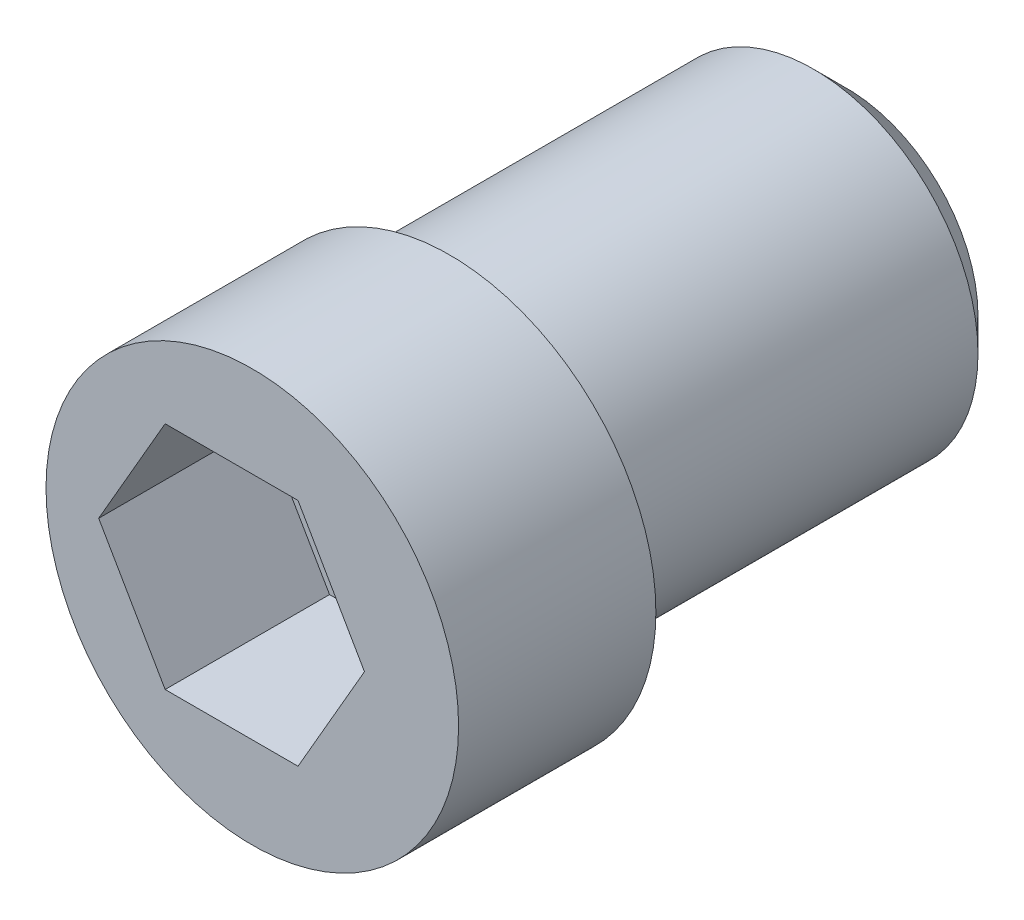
ISO-10303-21;
HEADER;
FILE_DESCRIPTION(('STEP AP214'),'2;1');
FILE_NAME('part.step','',(''),(''),'','','');
FILE_SCHEMA(('AUTOMOTIVE_DESIGN { 1 0 10303 214 1 1 1 1 }'));
ENDSEC;
DATA;
#1=APPLICATION_CONTEXT('core data for automotive mechanical design processes');
#2=APPLICATION_PROTOCOL_DEFINITION('international standard','automotive_design',2000,#1);
#3=PRODUCT_CONTEXT('',#1,'mechanical');
#4=PRODUCT('Part','Part','',(#3));
#5=PRODUCT_RELATED_PRODUCT_CATEGORY('part','',(#4));
#6=PRODUCT_DEFINITION_FORMATION('','',#4);
#7=PRODUCT_DEFINITION_CONTEXT('part definition',#1,'design');
#8=PRODUCT_DEFINITION('design','',#6,#7);
#9=PRODUCT_DEFINITION_SHAPE('','',#8);
#10=(LENGTH_UNIT() NAMED_UNIT(*) SI_UNIT(.MILLI.,.METRE.));
#11=(NAMED_UNIT(*) PLANE_ANGLE_UNIT() SI_UNIT($,.RADIAN.));
#12=(NAMED_UNIT(*) SI_UNIT($,.STERADIAN.) SOLID_ANGLE_UNIT());
#13=UNCERTAINTY_MEASURE_WITH_UNIT(LENGTH_MEASURE(1.E-05),#10,'distance_accuracy_value','');
#14=(GEOMETRIC_REPRESENTATION_CONTEXT(3) GLOBAL_UNCERTAINTY_ASSIGNED_CONTEXT((#13)) GLOBAL_UNIT_ASSIGNED_CONTEXT((#10,
#11,#12)) REPRESENTATION_CONTEXT('',''));
#15=CARTESIAN_POINT('',(0.,0.,0.));
#16=DIRECTION('',(0.,0.,1.));
#17=DIRECTION('',(1.,0.,0.));
#18=AXIS2_PLACEMENT_3D('',#15,#16,#17);
#19=CARTESIAN_POINT('',(0.,0.,-26.842135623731));
#20=DIRECTION('',(0.,0.,1.));
#21=DIRECTION('',(-1.,0.,0.));
#22=AXIS2_PLACEMENT_3D('',#19,#20,#21);
#23=CYLINDRICAL_SURFACE('',#22,5.);
#24=CARTESIAN_POINT('',(0.,0.,-11.7));
#25=DIRECTION('',(0.,0.,1.));
#26=DIRECTION('',(-1.,0.,0.));
#27=AXIS2_PLACEMENT_3D('',#24,#25,#26);
#28=CIRCLE('',#27,5.);
#29=CARTESIAN_POINT('',(-5.,0.,-11.7));
#30=VERTEX_POINT('',#29);
#31=EDGE_CURVE('E22',#30,#30,#28,.T.);
#32=ORIENTED_EDGE('',*,*,#31,.T.);
#33=EDGE_LOOP('',(#32));
#34=FACE_BOUND('',#33,.T.);
#35=CARTESIAN_POINT('',(0.,0.,0.));
#36=DIRECTION('',(0.,0.,-1.));
#37=DIRECTION('',(-1.,0.,0.));
#38=AXIS2_PLACEMENT_3D('',#35,#36,#37);
#39=CIRCLE('',#38,5.);
#40=CARTESIAN_POINT('',(-5.,0.,0.));
#41=VERTEX_POINT('',#40);
#42=EDGE_CURVE('E125',#41,#41,#39,.T.);
#43=ORIENTED_EDGE('',*,*,#42,.T.);
#44=EDGE_LOOP('',(#43));
#45=FACE_BOUND('',#44,.T.);
#46=ADVANCED_FACE('F14',(#34,#45),#23,.T.);
#47=CARTESIAN_POINT('',(0.,0.,-12.7));
#48=DIRECTION('',(0.,0.,1.));
#49=DIRECTION('',(-1.,0.,0.));
#50=AXIS2_PLACEMENT_3D('',#47,#48,#49);
#51=PLANE('',#50);
#52=CARTESIAN_POINT('',(0.,0.,-12.7));
#53=DIRECTION('',(0.,0.,1.));
#54=DIRECTION('',(-1.,0.,0.));
#55=AXIS2_PLACEMENT_3D('',#52,#53,#54);
#56=CIRCLE('',#55,4.);
#57=CARTESIAN_POINT('',(-4.,0.,-12.7));
#58=VERTEX_POINT('',#57);
#59=EDGE_CURVE('E9',#58,#58,#56,.F.);
#60=ORIENTED_EDGE('',*,*,#59,.T.);
#61=EDGE_LOOP('',(#60));
#62=FACE_BOUND('',#61,.T.);
#63=ADVANCED_FACE('F136',(#62),#51,.F.);
#64=CARTESIAN_POINT('',(0.,0.,-11.7));
#65=DIRECTION('',(0.,0.,1.));
#66=DIRECTION('',(-1.,0.,0.));
#67=AXIS2_PLACEMENT_3D('',#64,#65,#66);
#68=CONICAL_SURFACE('',#67,5.,0.785398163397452);
#69=ORIENTED_EDGE('',*,*,#59,.F.);
#70=EDGE_LOOP('',(#69));
#71=FACE_BOUND('',#70,.T.);
#72=ORIENTED_EDGE('',*,*,#31,.F.);
#73=EDGE_LOOP('',(#72));
#74=FACE_BOUND('',#73,.T.);
#75=ADVANCED_FACE('F16',(#71,#74),#68,.T.);
#76=CARTESIAN_POINT('',(0.63,0.,6.));
#77=DIRECTION('',(0.,0.,-1.));
#78=DIRECTION('',(-1.,0.,0.));
#79=AXIS2_PLACEMENT_3D('',#76,#77,#78);
#80=CYLINDRICAL_SURFACE('',#79,6.2738);
#81=CARTESIAN_POINT('',(0.63,0.,6.));
#82=DIRECTION('',(0.,0.,1.));
#83=DIRECTION('',(1.,0.,0.));
#84=AXIS2_PLACEMENT_3D('',#81,#82,#83);
#85=CIRCLE('',#84,6.2738);
#86=CARTESIAN_POINT('',(6.9038,0.,6.));
#87=VERTEX_POINT('',#86);
#88=EDGE_CURVE('E122',#87,#87,#85,.T.);
#89=ORIENTED_EDGE('',*,*,#88,.F.);
#90=EDGE_LOOP('',(#89));
#91=FACE_BOUND('',#90,.T.);
#92=CARTESIAN_POINT('',(0.63,0.,0.));
#93=DIRECTION('',(0.,0.,1.));
#94=DIRECTION('',(1.,0.,0.));
#95=AXIS2_PLACEMENT_3D('',#92,#93,#94);
#96=CIRCLE('',#95,6.2738);
#97=CARTESIAN_POINT('',(6.9038,0.,0.));
#98=VERTEX_POINT('',#97);
#99=EDGE_CURVE('E116',#98,#98,#96,.T.);
#100=ORIENTED_EDGE('',*,*,#99,.T.);
#101=EDGE_LOOP('',(#100));
#102=FACE_BOUND('',#101,.T.);
#103=ADVANCED_FACE('F135',(#91,#102),#80,.T.);
#104=CARTESIAN_POINT('',(0.63,0.,6.));
#105=DIRECTION('',(0.,0.,1.));
#106=DIRECTION('',(1.,0.,0.));
#107=AXIS2_PLACEMENT_3D('',#104,#105,#106);
#108=PLANE('',#107);
#109=DIRECTION('',(0.5,0.866025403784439,0.));
#110=VECTOR('',#109,1.);
#111=CARTESIAN_POINT('',(2.02072594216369,-3.5,6.));
#112=LINE('',#111,#110);
#113=CARTESIAN_POINT('',(2.02072594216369,-3.5,6.));
#114=VERTEX_POINT('',#113);
#115=CARTESIAN_POINT('',(4.04145188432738,0.,6.));
#116=VERTEX_POINT('',#115);
#117=EDGE_CURVE('E29',#114,#116,#112,.T.);
#118=ORIENTED_EDGE('',*,*,#117,.F.);
#119=DIRECTION('',(1.,0.,0.));
#120=VECTOR('',#119,1.);
#121=CARTESIAN_POINT('',(-2.02072594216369,-3.5,6.));
#122=LINE('',#121,#120);
#123=CARTESIAN_POINT('',(-2.02072594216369,-3.5,6.));
#124=VERTEX_POINT('',#123);
#125=EDGE_CURVE('E112',#124,#114,#122,.T.);
#126=ORIENTED_EDGE('',*,*,#125,.F.);
#127=DIRECTION('',(0.5,-0.866025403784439,0.));
#128=VECTOR('',#127,1.);
#129=CARTESIAN_POINT('',(-4.04145188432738,0.,6.));
#130=LINE('',#129,#128);
#131=CARTESIAN_POINT('',(-4.04145188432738,0.,6.));
#132=VERTEX_POINT('',#131);
#133=EDGE_CURVE('E110',#132,#124,#130,.T.);
#134=ORIENTED_EDGE('',*,*,#133,.F.);
#135=DIRECTION('',(-0.5,-0.866025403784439,0.));
#136=VECTOR('',#135,1.);
#137=CARTESIAN_POINT('',(-2.02072594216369,3.5,6.));
#138=LINE('',#137,#136);
#139=CARTESIAN_POINT('',(-2.02072594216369,3.5,6.));
#140=VERTEX_POINT('',#139);
#141=EDGE_CURVE('E77',#140,#132,#138,.T.);
#142=ORIENTED_EDGE('',*,*,#141,.F.);
#143=DIRECTION('',(-1.,0.,0.));
#144=VECTOR('',#143,1.);
#145=CARTESIAN_POINT('',(2.02072594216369,3.5,6.));
#146=LINE('',#145,#144);
#147=CARTESIAN_POINT('',(2.02072594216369,3.5,6.));
#148=VERTEX_POINT('',#147);
#149=EDGE_CURVE('E106',#148,#140,#146,.T.);
#150=ORIENTED_EDGE('',*,*,#149,.F.);
#151=DIRECTION('',(-0.5,0.866025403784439,0.));
#152=VECTOR('',#151,1.);
#153=CARTESIAN_POINT('',(4.04145188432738,0.,6.));
#154=LINE('',#153,#152);
#155=EDGE_CURVE('E103',#116,#148,#154,.T.);
#156=ORIENTED_EDGE('',*,*,#155,.F.);
#157=EDGE_LOOP('',(#118,#126,#134,#142,#150,#156));
#158=FACE_BOUND('',#157,.T.);
#159=ORIENTED_EDGE('',*,*,#88,.T.);
#160=EDGE_LOOP('',(#159));
#161=FACE_BOUND('',#160,.T.);
#162=ADVANCED_FACE('F144',(#158,#161),#108,.T.);
#163=CARTESIAN_POINT('',(0.63,0.,0.));
#164=DIRECTION('',(0.,0.,1.));
#165=DIRECTION('',(1.,0.,0.));
#166=AXIS2_PLACEMENT_3D('',#163,#164,#165);
#167=PLANE('',#166);
#168=ORIENTED_EDGE('',*,*,#42,.F.);
#169=EDGE_LOOP('',(#168));
#170=FACE_BOUND('',#169,.T.);
#171=ORIENTED_EDGE('',*,*,#99,.F.);
#172=EDGE_LOOP('',(#171));
#173=FACE_BOUND('',#172,.T.);
#174=ADVANCED_FACE('F155',(#170,#173),#167,.F.);
#175=CARTESIAN_POINT('',(2.02072594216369,-3.5,1.));
#176=DIRECTION('',(0.866025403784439,-0.5,0.));
#177=DIRECTION('',(0.5,0.866025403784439,0.));
#178=AXIS2_PLACEMENT_3D('',#175,#176,#177);
#179=PLANE('',#178);
#180=ORIENTED_EDGE('',*,*,#117,.T.);
#181=DIRECTION('',(0.,0.,1.));
#182=VECTOR('',#181,1.);
#183=CARTESIAN_POINT('',(4.04145188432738,0.,1.));
#184=LINE('',#183,#182);
#185=CARTESIAN_POINT('',(4.04145188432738,0.,1.));
#186=VERTEX_POINT('',#185);
#187=EDGE_CURVE('E59',#186,#116,#184,.T.);
#188=ORIENTED_EDGE('',*,*,#187,.F.);
#189=DIRECTION('',(0.5,0.866025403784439,0.));
#190=VECTOR('',#189,1.);
#191=CARTESIAN_POINT('',(2.02072594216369,-3.5,1.));
#192=LINE('',#191,#190);
#193=CARTESIAN_POINT('',(2.02072594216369,-3.5,1.));
#194=VERTEX_POINT('',#193);
#195=EDGE_CURVE('E114',#194,#186,#192,.T.);
#196=ORIENTED_EDGE('',*,*,#195,.F.);
#197=DIRECTION('',(0.,0.,1.));
#198=VECTOR('',#197,1.);
#199=CARTESIAN_POINT('',(2.02072594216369,-3.5,1.));
#200=LINE('',#199,#198);
#201=EDGE_CURVE('E37',#194,#114,#200,.T.);
#202=ORIENTED_EDGE('',*,*,#201,.T.);
#203=EDGE_LOOP('',(#180,#188,#196,#202));
#204=FACE_BOUND('',#203,.T.);
#205=ADVANCED_FACE('F158',(#204),#179,.F.);
#206=CARTESIAN_POINT('',(-2.02072594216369,-3.5,1.));
#207=DIRECTION('',(0.,-1.,0.));
#208=DIRECTION('',(0.,0.,-1.));
#209=AXIS2_PLACEMENT_3D('',#206,#207,#208);
#210=PLANE('',#209);
#211=ORIENTED_EDGE('',*,*,#125,.T.);
#212=ORIENTED_EDGE('',*,*,#201,.F.);
#213=DIRECTION('',(1.,0.,0.));
#214=VECTOR('',#213,1.);
#215=CARTESIAN_POINT('',(-2.02072594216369,-3.5,1.));
#216=LINE('',#215,#214);
#217=CARTESIAN_POINT('',(-2.02072594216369,-3.5,1.));
#218=VERTEX_POINT('',#217);
#219=EDGE_CURVE('E89',#218,#194,#216,.T.);
#220=ORIENTED_EDGE('',*,*,#219,.F.);
#221=DIRECTION('',(0.,0.,1.));
#222=VECTOR('',#221,1.);
#223=CARTESIAN_POINT('',(-2.02072594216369,-3.5,1.));
#224=LINE('',#223,#222);
#225=EDGE_CURVE('E81',#218,#124,#224,.T.);
#226=ORIENTED_EDGE('',*,*,#225,.T.);
#227=EDGE_LOOP('',(#211,#212,#220,#226));
#228=FACE_BOUND('',#227,.T.);
#229=ADVANCED_FACE('F165',(#228),#210,.F.);
#230=CARTESIAN_POINT('',(-4.04145188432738,0.,1.));
#231=DIRECTION('',(-0.866025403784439,-0.5,0.));
#232=DIRECTION('',(0.5,-0.866025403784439,0.));
#233=AXIS2_PLACEMENT_3D('',#230,#231,#232);
#234=PLANE('',#233);
#235=ORIENTED_EDGE('',*,*,#133,.T.);
#236=ORIENTED_EDGE('',*,*,#225,.F.);
#237=DIRECTION('',(0.5,-0.866025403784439,0.));
#238=VECTOR('',#237,1.);
#239=CARTESIAN_POINT('',(-4.04145188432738,0.,1.));
#240=LINE('',#239,#238);
#241=CARTESIAN_POINT('',(-4.04145188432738,0.,1.));
#242=VERTEX_POINT('',#241);
#243=EDGE_CURVE('E85',#242,#218,#240,.T.);
#244=ORIENTED_EDGE('',*,*,#243,.F.);
#245=DIRECTION('',(0.,0.,1.));
#246=VECTOR('',#245,1.);
#247=CARTESIAN_POINT('',(-4.04145188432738,0.,1.));
#248=LINE('',#247,#246);
#249=EDGE_CURVE('E70',#242,#132,#248,.T.);
#250=ORIENTED_EDGE('',*,*,#249,.T.);
#251=EDGE_LOOP('',(#235,#236,#244,#250));
#252=FACE_BOUND('',#251,.T.);
#253=ADVANCED_FACE('F86',(#252),#234,.F.);
#254=CARTESIAN_POINT('',(-2.02072594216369,3.5,1.));
#255=DIRECTION('',(-0.866025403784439,0.5,0.));
#256=DIRECTION('',(-0.5,-0.866025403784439,0.));
#257=AXIS2_PLACEMENT_3D('',#254,#255,#256);
#258=PLANE('',#257);
#259=ORIENTED_EDGE('',*,*,#141,.T.);
#260=ORIENTED_EDGE('',*,*,#249,.F.);
#261=DIRECTION('',(-0.5,-0.866025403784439,0.));
#262=VECTOR('',#261,1.);
#263=CARTESIAN_POINT('',(-2.02072594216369,3.5,1.));
#264=LINE('',#263,#262);
#265=CARTESIAN_POINT('',(-2.02072594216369,3.5,1.));
#266=VERTEX_POINT('',#265);
#267=EDGE_CURVE('E74',#266,#242,#264,.T.);
#268=ORIENTED_EDGE('',*,*,#267,.F.);
#269=DIRECTION('',(0.,0.,1.));
#270=VECTOR('',#269,1.);
#271=CARTESIAN_POINT('',(-2.02072594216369,3.5,1.));
#272=LINE('',#271,#270);
#273=EDGE_CURVE('E82',#266,#140,#272,.T.);
#274=ORIENTED_EDGE('',*,*,#273,.T.);
#275=EDGE_LOOP('',(#259,#260,#268,#274));
#276=FACE_BOUND('',#275,.T.);
#277=ADVANCED_FACE('F72',(#276),#258,.F.);
#278=CARTESIAN_POINT('',(2.02072594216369,3.5,1.));
#279=DIRECTION('',(0.,1.,0.));
#280=DIRECTION('',(-1.,0.,0.));
#281=AXIS2_PLACEMENT_3D('',#278,#279,#280);
#282=PLANE('',#281);
#283=ORIENTED_EDGE('',*,*,#149,.T.);
#284=ORIENTED_EDGE('',*,*,#273,.F.);
#285=DIRECTION('',(-1.,0.,0.));
#286=VECTOR('',#285,1.);
#287=CARTESIAN_POINT('',(2.02072594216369,3.5,1.));
#288=LINE('',#287,#286);
#289=CARTESIAN_POINT('',(2.02072594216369,3.5,1.));
#290=VERTEX_POINT('',#289);
#291=EDGE_CURVE('E95',#290,#266,#288,.T.);
#292=ORIENTED_EDGE('',*,*,#291,.F.);
#293=DIRECTION('',(0.,0.,1.));
#294=VECTOR('',#293,1.);
#295=CARTESIAN_POINT('',(2.02072594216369,3.5,1.));
#296=LINE('',#295,#294);
#297=EDGE_CURVE('E119',#290,#148,#296,.T.);
#298=ORIENTED_EDGE('',*,*,#297,.T.);
#299=EDGE_LOOP('',(#283,#284,#292,#298));
#300=FACE_BOUND('',#299,.T.);
#301=ADVANCED_FACE('F169',(#300),#282,.F.);
#302=CARTESIAN_POINT('',(4.04145188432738,0.,1.));
#303=DIRECTION('',(0.866025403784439,0.5,0.));
#304=DIRECTION('',(-0.5,0.866025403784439,0.));
#305=AXIS2_PLACEMENT_3D('',#302,#303,#304);
#306=PLANE('',#305);
#307=ORIENTED_EDGE('',*,*,#155,.T.);
#308=ORIENTED_EDGE('',*,*,#297,.F.);
#309=DIRECTION('',(-0.5,0.866025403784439,0.));
#310=VECTOR('',#309,1.);
#311=CARTESIAN_POINT('',(4.04145188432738,0.,1.));
#312=LINE('',#311,#310);
#313=EDGE_CURVE('E97',#186,#290,#312,.T.);
#314=ORIENTED_EDGE('',*,*,#313,.F.);
#315=ORIENTED_EDGE('',*,*,#187,.T.);
#316=EDGE_LOOP('',(#307,#308,#314,#315));
#317=FACE_BOUND('',#316,.T.);
#318=ADVANCED_FACE('F166',(#317),#306,.F.);
#319=CARTESIAN_POINT('',(0.,0.,1.));
#320=DIRECTION('',(0.,0.,1.));
#321=DIRECTION('',(1.,0.,0.));
#322=AXIS2_PLACEMENT_3D('',#319,#320,#321);
#323=PLANE('',#322);
#324=ORIENTED_EDGE('',*,*,#195,.T.);
#325=ORIENTED_EDGE('',*,*,#313,.T.);
#326=ORIENTED_EDGE('',*,*,#291,.T.);
#327=ORIENTED_EDGE('',*,*,#267,.T.);
#328=ORIENTED_EDGE('',*,*,#243,.T.);
#329=ORIENTED_EDGE('',*,*,#219,.T.);
#330=EDGE_LOOP('',(#324,#325,#326,#327,#328,#329));
#331=FACE_BOUND('',#330,.T.);
#332=ADVANCED_FACE('F92',(#331),#323,.T.);
#333=CLOSED_SHELL('',(#46,#63,#75,#103,#162,#174,#205,#229,#253,#277,#301,#318,#332));
#334=MANIFOLD_SOLID_BREP('B1',#333);
#335=ADVANCED_BREP_SHAPE_REPRESENTATION('',(#18,#334),#14);
#336=SHAPE_DEFINITION_REPRESENTATION(#9,#335);
ENDSEC;
END-ISO-10303-21;
